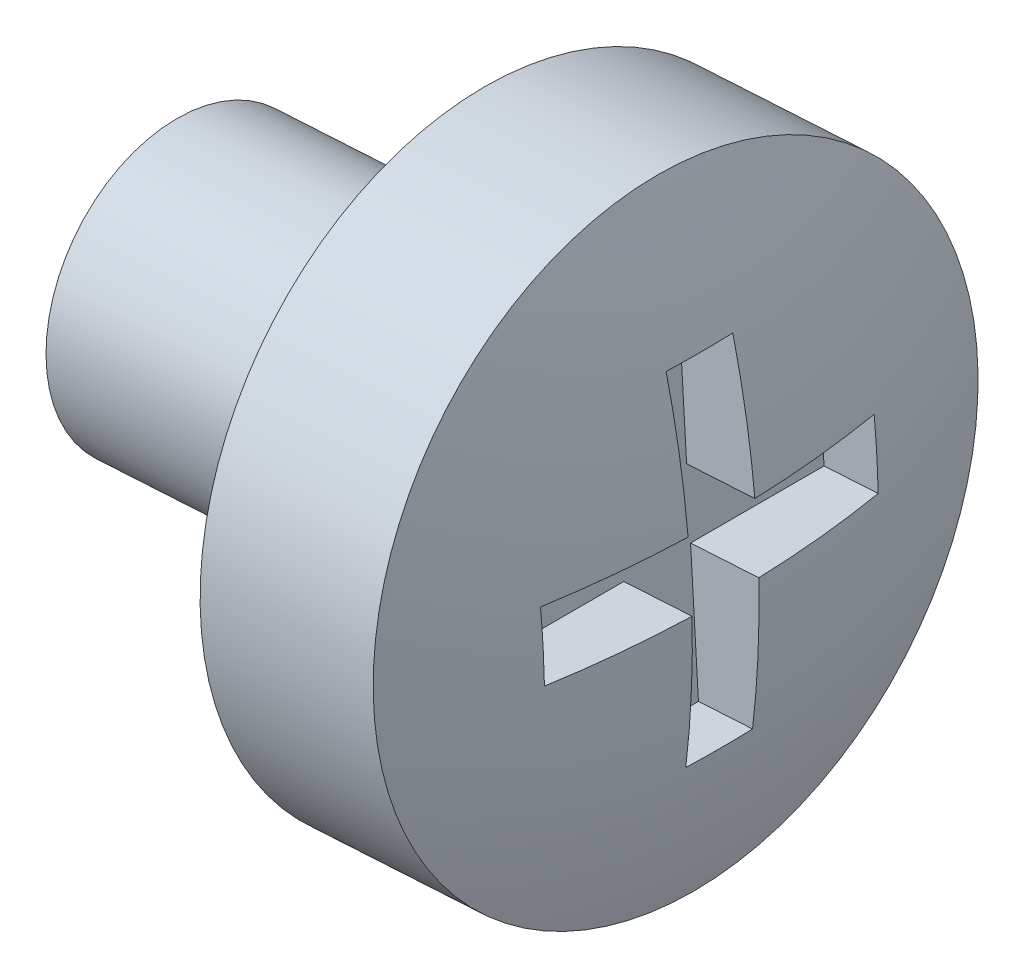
ISO-10303-21;
HEADER;
FILE_DESCRIPTION(('STEP AP214'),'2;1');
FILE_NAME('part.step','',(''),(''),'','','');
FILE_SCHEMA(('AUTOMOTIVE_DESIGN { 1 0 10303 214 1 1 1 1 }'));
ENDSEC;
DATA;
#1=APPLICATION_CONTEXT('core data for automotive mechanical design processes');
#2=APPLICATION_PROTOCOL_DEFINITION('international standard','automotive_design',2000,#1);
#3=PRODUCT_CONTEXT('',#1,'mechanical');
#4=PRODUCT('Part','Part','',(#3));
#5=PRODUCT_RELATED_PRODUCT_CATEGORY('part','',(#4));
#6=PRODUCT_DEFINITION_FORMATION('','',#4);
#7=PRODUCT_DEFINITION_CONTEXT('part definition',#1,'design');
#8=PRODUCT_DEFINITION('design','',#6,#7);
#9=PRODUCT_DEFINITION_SHAPE('','',#8);
#10=(LENGTH_UNIT() NAMED_UNIT(*) SI_UNIT(.MILLI.,.METRE.));
#11=(NAMED_UNIT(*) PLANE_ANGLE_UNIT() SI_UNIT($,.RADIAN.));
#12=(NAMED_UNIT(*) SI_UNIT($,.STERADIAN.) SOLID_ANGLE_UNIT());
#13=UNCERTAINTY_MEASURE_WITH_UNIT(LENGTH_MEASURE(1.E-05),#10,'distance_accuracy_value','');
#14=(GEOMETRIC_REPRESENTATION_CONTEXT(3) GLOBAL_UNCERTAINTY_ASSIGNED_CONTEXT((#13)) GLOBAL_UNIT_ASSIGNED_CONTEXT((#10,
#11,#12)) REPRESENTATION_CONTEXT('',''));
#15=CARTESIAN_POINT('',(0.,0.,0.));
#16=DIRECTION('',(0.,0.,1.));
#17=DIRECTION('',(1.,0.,0.));
#18=AXIS2_PLACEMENT_3D('',#15,#16,#17);
#19=CARTESIAN_POINT('',(12.5670575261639,53.0490706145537,0.));
#20=DIRECTION('',(-0.998253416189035,-0.0590772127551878,0.));
#21=DIRECTION('',(0.0590772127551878,-0.998253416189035,0.));
#22=AXIS2_PLACEMENT_3D('',#19,#20,#21);
#23=PLANE('',#22);
#24=DIRECTION('',(0.,0.,1.));
#25=VECTOR('',#24,1.);
#26=CARTESIAN_POINT('',(12.6911196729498,50.9527384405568,0.));
#27=LINE('',#26,#25);
#28=CARTESIAN_POINT('',(12.6911196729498,50.9527384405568,-0.42));
#29=VERTEX_POINT('',#28);
#30=CARTESIAN_POINT('',(12.6911196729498,50.9527384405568,0.42));
#31=VERTEX_POINT('',#30);
#32=EDGE_CURVE('E87',#29,#31,#27,.T.);
#33=ORIENTED_EDGE('',*,*,#32,.F.);
#34=DIRECTION('',(0.0590772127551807,-0.998253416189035,0.));
#35=VECTOR('',#34,1.);
#36=CARTESIAN_POINT('',(12.5918699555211,52.6298041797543,-0.42));
#37=LINE('',#36,#35);
#38=CARTESIAN_POINT('',(12.5918699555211,52.6298041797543,-0.42));
#39=VERTEX_POINT('',#38);
#40=EDGE_CURVE('E131',#39,#29,#37,.T.);
#41=ORIENTED_EDGE('',*,*,#40,.F.);
#42=DIRECTION('',(0.,0.,1.));
#43=VECTOR('',#42,1.);
#44=CARTESIAN_POINT('',(12.5918699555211,52.6298041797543,0.));
#45=LINE('',#44,#43);
#46=CARTESIAN_POINT('',(12.5918699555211,52.6298041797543,-2.1));
#47=VERTEX_POINT('',#46);
#48=EDGE_CURVE('E121',#47,#39,#45,.T.);
#49=ORIENTED_EDGE('',*,*,#48,.F.);
#50=DIRECTION('',(0.059077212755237,-0.998253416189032,0.));
#51=VECTOR('',#50,1.);
#52=CARTESIAN_POINT('',(12.5422450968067,53.4683370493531,-2.1));
#53=LINE('',#52,#51);
#54=CARTESIAN_POINT('',(12.5422450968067,53.4683370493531,-2.1));
#55=VERTEX_POINT('',#54);
#56=EDGE_CURVE('E144',#55,#47,#53,.T.);
#57=ORIENTED_EDGE('',*,*,#56,.F.);
#58=DIRECTION('',(0.,0.,1.));
#59=VECTOR('',#58,1.);
#60=CARTESIAN_POINT('',(12.5422450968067,53.4683370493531,0.));
#61=LINE('',#60,#59);
#62=CARTESIAN_POINT('',(12.5422450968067,53.4683370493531,-0.42));
#63=VERTEX_POINT('',#62);
#64=EDGE_CURVE('E150',#63,#55,#61,.F.);
#65=ORIENTED_EDGE('',*,*,#64,.F.);
#66=DIRECTION('',(0.0590772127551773,-0.998253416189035,0.));
#67=VECTOR('',#66,1.);
#68=CARTESIAN_POINT('',(12.442995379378,55.1454027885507,-0.42));
#69=LINE('',#68,#67);
#70=CARTESIAN_POINT('',(12.442995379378,55.1454027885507,-0.42));
#71=VERTEX_POINT('',#70);
#72=EDGE_CURVE('E156',#71,#63,#69,.T.);
#73=ORIENTED_EDGE('',*,*,#72,.F.);
#74=DIRECTION('',(0.,0.,1.));
#75=VECTOR('',#74,1.);
#76=CARTESIAN_POINT('',(12.442995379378,55.1454027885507,0.));
#77=LINE('',#76,#75);
#78=CARTESIAN_POINT('',(12.442995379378,55.1454027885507,0.42));
#79=VERTEX_POINT('',#78);
#80=EDGE_CURVE('E162',#79,#71,#77,.F.);
#81=ORIENTED_EDGE('',*,*,#80,.F.);
#82=DIRECTION('',(-0.0590772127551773,0.998253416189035,0.));
#83=VECTOR('',#82,1.);
#84=CARTESIAN_POINT('',(12.5422450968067,53.4683370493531,0.42));
#85=LINE('',#84,#83);
#86=CARTESIAN_POINT('',(12.5422450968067,53.4683370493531,0.42));
#87=VERTEX_POINT('',#86);
#88=EDGE_CURVE('E168',#87,#79,#85,.T.);
#89=ORIENTED_EDGE('',*,*,#88,.F.);
#90=DIRECTION('',(0.,0.,1.));
#91=VECTOR('',#90,1.);
#92=CARTESIAN_POINT('',(12.5422450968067,53.4683370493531,0.));
#93=LINE('',#92,#91);
#94=CARTESIAN_POINT('',(12.5422450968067,53.4683370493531,2.1));
#95=VERTEX_POINT('',#94);
#96=EDGE_CURVE('E174',#95,#87,#93,.F.);
#97=ORIENTED_EDGE('',*,*,#96,.F.);
#98=DIRECTION('',(-0.059077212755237,0.998253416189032,0.));
#99=VECTOR('',#98,1.);
#100=CARTESIAN_POINT('',(12.5918699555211,52.6298041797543,2.1));
#101=LINE('',#100,#99);
#102=CARTESIAN_POINT('',(12.5918699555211,52.6298041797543,2.1));
#103=VERTEX_POINT('',#102);
#104=EDGE_CURVE('E180',#103,#95,#101,.T.);
#105=ORIENTED_EDGE('',*,*,#104,.F.);
#106=DIRECTION('',(0.,0.,1.));
#107=VECTOR('',#106,1.);
#108=CARTESIAN_POINT('',(12.5918699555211,52.6298041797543,0.));
#109=LINE('',#108,#107);
#110=CARTESIAN_POINT('',(12.5918699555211,52.6298041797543,0.42));
#111=VERTEX_POINT('',#110);
#112=EDGE_CURVE('E186',#111,#103,#109,.T.);
#113=ORIENTED_EDGE('',*,*,#112,.F.);
#114=DIRECTION('',(-0.0590772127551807,0.998253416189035,0.));
#115=VECTOR('',#114,1.);
#116=CARTESIAN_POINT('',(12.6911196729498,50.9527384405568,0.42));
#117=LINE('',#116,#115);
#118=EDGE_CURVE('E190',#31,#111,#117,.T.);
#119=ORIENTED_EDGE('',*,*,#118,.F.);
#120=EDGE_LOOP('',(#33,#41,#49,#57,#65,#73,#81,#89,#97,#105,#113,#119));
#121=FACE_BOUND('',#120,.T.);
#122=ADVANCED_FACE('F16',(#121),#23,.F.);
#123=CARTESIAN_POINT('',(13.0037933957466,53.0749168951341,0.42));
#124=DIRECTION('',(0.,0.,-1.));
#125=DIRECTION('',(-1.,0.,0.));
#126=AXIS2_PLACEMENT_3D('',#123,#124,#125);
#127=PLANE('',#126);
#128=DIRECTION('',(-0.998253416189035,-0.0590772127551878,0.));
#129=VECTOR('',#128,1.);
#130=CARTESIAN_POINT('',(13.1278555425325,50.9785847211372,0.42));
#131=LINE('',#130,#129);
#132=CARTESIAN_POINT('',(13.3722815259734,50.9930499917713,0.419999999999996));
#133=VERTEX_POINT('',#132);
#134=EDGE_CURVE('E372',#31,#133,#131,.F.);
#135=ORIENTED_EDGE('',*,*,#134,.F.);
#136=ORIENTED_EDGE('',*,*,#118,.T.);
#137=DIRECTION('',(-0.998253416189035,-0.0590772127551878,0.));
#138=VECTOR('',#137,1.);
#139=CARTESIAN_POINT('',(13.0286058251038,52.6556504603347,0.42));
#140=LINE('',#139,#138);
#141=CARTESIAN_POINT('',(13.4506583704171,52.6806277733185,0.42));
#142=VERTEX_POINT('',#141);
#143=EDGE_CURVE('E75',#142,#111,#140,.T.);
#144=ORIENTED_EDGE('',*,*,#143,.F.);
#145=CARTESIAN_POINT('',(13.3722815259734,50.9930499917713,0.419999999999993));
#146=CARTESIAN_POINT('',(13.4051796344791,51.2733917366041,0.419999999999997));
#147=CARTESIAN_POINT('',(13.4281600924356,51.5541940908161,0.419999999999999));
#148=CARTESIAN_POINT('',(13.4542857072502,52.1167200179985,0.420000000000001));
#149=CARTESIAN_POINT('',(13.4574308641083,52.3984435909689,0.42));
#150=CARTESIAN_POINT('',(13.4506583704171,52.6806277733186,0.419999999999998));
#151=B_SPLINE_CURVE_WITH_KNOTS('',3,(#145,#146,#147,#148,#149,#150),.UNSPECIFIED.,.F.,.F.,(4,2,
4),(0.,0.845223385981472,1.69044677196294),.UNSPECIFIED.);
#152=EDGE_CURVE('E19',#133,#142,#151,.T.);
#153=ORIENTED_EDGE('',*,*,#152,.F.);
#154=EDGE_LOOP('',(#135,#136,#144,#153));
#155=FACE_BOUND('',#154,.T.);
#156=ADVANCED_FACE('F316',(#155),#127,.T.);
#157=CARTESIAN_POINT('',(13.0286058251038,52.6556504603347,0.));
#158=DIRECTION('',(-0.0590772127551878,0.998253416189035,0.));
#159=DIRECTION('',(-0.998253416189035,-0.0590772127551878,0.));
#160=AXIS2_PLACEMENT_3D('',#157,#158,#159);
#161=PLANE('',#160);
#162=ORIENTED_EDGE('',*,*,#112,.T.);
#163=DIRECTION('',(-0.998253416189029,-0.0590772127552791,0.));
#164=VECTOR('',#163,1.);
#165=CARTESIAN_POINT('',(13.2730318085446,52.6701157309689,2.1));
#166=LINE('',#165,#164);
#167=CARTESIAN_POINT('',(13.2730318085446,52.6701157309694,2.1));
#168=VERTEX_POINT('',#167);
#169=EDGE_CURVE('E183',#168,#103,#166,.T.);
#170=ORIENTED_EDGE('',*,*,#169,.F.);
#171=CARTESIAN_POINT('',(1.48630070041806,51.9725701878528,0.));
#172=DIRECTION('',(0.0590772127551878,-0.998253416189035,0.));
#173=DIRECTION('',(0.998253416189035,0.0590772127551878,0.));
#174=AXIS2_PLACEMENT_3D('',#171,#172,#173);
#175=CIRCLE('',#174,11.9926477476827);
#176=EDGE_CURVE('E308',#142,#168,#175,.T.);
#177=ORIENTED_EDGE('',*,*,#176,.F.);
#178=ORIENTED_EDGE('',*,*,#143,.T.);
#179=EDGE_LOOP('',(#162,#170,#177,#178));
#180=FACE_BOUND('',#179,.T.);
#181=ADVANCED_FACE('F313',(#180),#161,.T.);
#182=CARTESIAN_POINT('',(13.0037933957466,53.0749168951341,2.1));
#183=DIRECTION('',(0.,0.,-1.));
#184=DIRECTION('',(-1.,0.,0.));
#185=AXIS2_PLACEMENT_3D('',#182,#183,#184);
#186=PLANE('',#185);
#187=ORIENTED_EDGE('',*,*,#104,.T.);
#188=DIRECTION('',(0.998253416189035,0.0590772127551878,0.));
#189=VECTOR('',#188,1.);
#190=CARTESIAN_POINT('',(12.9789809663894,53.4941833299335,2.1));
#191=LINE('',#190,#189);
#192=CARTESIAN_POINT('',(13.2234069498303,53.5086486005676,2.1));
#193=VERTEX_POINT('',#192);
#194=EDGE_CURVE('E177',#193,#95,#191,.F.);
#195=ORIENTED_EDGE('',*,*,#194,.F.);
#196=CARTESIAN_POINT('',(13.2730318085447,52.6701157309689,2.1));
#197=CARTESIAN_POINT('',(13.2697306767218,52.8101653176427,2.1));
#198=CARTESIAN_POINT('',(13.2639447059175,52.9500678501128,2.1));
#199=CARTESIAN_POINT('',(13.247403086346,53.2295788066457,2.1));
#200=CARTESIAN_POINT('',(13.2366474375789,53.3691872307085,2.1));
#201=CARTESIAN_POINT('',(13.2234069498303,53.5086486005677,2.1));
#202=B_SPLINE_CURVE_WITH_KNOTS('',3,(#196,#197,#198,#199,#200,#201),.UNSPECIFIED.,.F.,.F.,(4,2,
4),(0.,0.420066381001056,0.840132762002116),.UNSPECIFIED.);
#203=EDGE_CURVE('E303',#168,#193,#202,.T.);
#204=ORIENTED_EDGE('',*,*,#203,.F.);
#205=ORIENTED_EDGE('',*,*,#169,.T.);
#206=EDGE_LOOP('',(#187,#195,#204,#205));
#207=FACE_BOUND('',#206,.T.);
#208=ADVANCED_FACE('F309',(#207),#186,.T.);
#209=CARTESIAN_POINT('',(12.9789809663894,53.4941833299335,0.));
#210=DIRECTION('',(0.0590772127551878,-0.998253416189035,0.));
#211=DIRECTION('',(0.998253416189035,0.0590772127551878,0.));
#212=AXIS2_PLACEMENT_3D('',#209,#210,#211);
#213=PLANE('',#212);
#214=ORIENTED_EDGE('',*,*,#96,.T.);
#215=DIRECTION('',(-0.99825341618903,-0.0590772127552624,0.));
#216=VECTOR('',#215,1.);
#217=CARTESIAN_POINT('',(13.4010335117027,53.5191606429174,0.42));
#218=LINE('',#217,#216);
#219=CARTESIAN_POINT('',(13.4010335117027,53.5191606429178,0.419999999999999));
#220=VERTEX_POINT('',#219);
#221=EDGE_CURVE('E171',#220,#87,#218,.T.);
#222=ORIENTED_EDGE('',*,*,#221,.F.);
#223=CARTESIAN_POINT('',(1.4366758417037,52.8111030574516,0.));
#224=DIRECTION('',(0.0590772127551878,-0.998253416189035,0.));
#225=DIRECTION('',(0.998253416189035,0.0590772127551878,0.));
#226=AXIS2_PLACEMENT_3D('',#223,#224,#225);
#227=CIRCLE('',#226,11.9926477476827);
#228=EDGE_CURVE('E300',#193,#220,#227,.F.);
#229=ORIENTED_EDGE('',*,*,#228,.F.);
#230=ORIENTED_EDGE('',*,*,#194,.T.);
#231=EDGE_LOOP('',(#214,#222,#229,#230));
#232=FACE_BOUND('',#231,.T.);
#233=ADVANCED_FACE('F291',(#232),#213,.T.);
#234=CARTESIAN_POINT('',(13.0037933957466,53.0749168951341,0.42));
#235=DIRECTION('',(0.,0.,-1.));
#236=DIRECTION('',(-1.,0.,0.));
#237=AXIS2_PLACEMENT_3D('',#234,#235,#236);
#238=PLANE('',#237);
#239=DIRECTION('',(0.998253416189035,0.0590772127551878,0.));
#240=VECTOR('',#239,1.);
#241=CARTESIAN_POINT('',(12.8797312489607,55.1712490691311,0.42));
#242=LINE('',#241,#240);
#243=CARTESIAN_POINT('',(13.1241572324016,55.1857143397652,0.42));
#244=VERTEX_POINT('',#243);
#245=EDGE_CURVE('E165',#244,#79,#242,.F.);
#246=ORIENTED_EDGE('',*,*,#245,.F.);
#247=CARTESIAN_POINT('',(13.4010335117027,53.5191606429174,0.419999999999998));
#248=CARTESIAN_POINT('',(13.3744756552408,53.8001739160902,0.42));
#249=CARTESIAN_POINT('',(13.3381237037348,54.0795600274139,0.42));
#250=CARTESIAN_POINT('',(13.2458316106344,54.6350779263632,0.42));
#251=CARTESIAN_POINT('',(13.1898914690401,54.9112097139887,0.419999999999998));
#252=CARTESIAN_POINT('',(13.1241572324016,55.1857143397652,0.419999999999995));
#253=B_SPLINE_CURVE_WITH_KNOTS('',3,(#247,#248,#249,#250,#251,#252),.UNSPECIFIED.,.F.,.F.,(4,2,
4),(0.,0.845223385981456,1.69044677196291),.UNSPECIFIED.);
#254=EDGE_CURVE('E294',#220,#244,#253,.T.);
#255=ORIENTED_EDGE('',*,*,#254,.F.);
#256=ORIENTED_EDGE('',*,*,#221,.T.);
#257=ORIENTED_EDGE('',*,*,#88,.T.);
#258=EDGE_LOOP('',(#246,#255,#256,#257));
#259=FACE_BOUND('',#258,.T.);
#260=ADVANCED_FACE('F286',(#259),#238,.T.);
#261=CARTESIAN_POINT('',(12.8797312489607,55.1712490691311,0.));
#262=DIRECTION('',(0.0590772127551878,-0.998253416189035,0.));
#263=DIRECTION('',(0.998253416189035,0.0590772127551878,0.));
#264=AXIS2_PLACEMENT_3D('',#261,#262,#263);
#265=PLANE('',#264);
#266=DIRECTION('',(-0.998253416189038,-0.0590772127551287,0.));
#267=VECTOR('',#266,1.);
#268=CARTESIAN_POINT('',(13.1241572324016,55.1857143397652,-0.42));
#269=LINE('',#268,#267);
#270=CARTESIAN_POINT('',(13.1241572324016,55.1857143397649,-0.420000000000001));
#271=VERTEX_POINT('',#270);
#272=EDGE_CURVE('E159',#271,#71,#269,.T.);
#273=ORIENTED_EDGE('',*,*,#272,.F.);
#274=CARTESIAN_POINT('',(1.33742612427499,54.4881687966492,0.));
#275=DIRECTION('',(0.0590772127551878,-0.998253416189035,0.));
#276=DIRECTION('',(0.998253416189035,0.0590772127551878,0.));
#277=AXIS2_PLACEMENT_3D('',#274,#275,#276);
#278=CIRCLE('',#277,11.8148212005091);
#279=EDGE_CURVE('E276',#244,#271,#278,.F.);
#280=ORIENTED_EDGE('',*,*,#279,.F.);
#281=ORIENTED_EDGE('',*,*,#245,.T.);
#282=ORIENTED_EDGE('',*,*,#80,.T.);
#283=EDGE_LOOP('',(#273,#280,#281,#282));
#284=FACE_BOUND('',#283,.T.);
#285=ADVANCED_FACE('F282',(#284),#265,.T.);
#286=CARTESIAN_POINT('',(13.0037933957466,53.0749168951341,-0.42));
#287=DIRECTION('',(0.,0.,1.));
#288=DIRECTION('',(1.,0.,0.));
#289=AXIS2_PLACEMENT_3D('',#286,#287,#288);
#290=PLANE('',#289);
#291=ORIENTED_EDGE('',*,*,#272,.T.);
#292=ORIENTED_EDGE('',*,*,#72,.T.);
#293=DIRECTION('',(0.998253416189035,0.0590772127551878,0.));
#294=VECTOR('',#293,1.);
#295=CARTESIAN_POINT('',(12.9789809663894,53.4941833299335,-0.42));
#296=LINE('',#295,#294);
#297=CARTESIAN_POINT('',(13.4010335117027,53.5191606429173,-0.42));
#298=VERTEX_POINT('',#297);
#299=EDGE_CURVE('E153',#298,#63,#296,.F.);
#300=ORIENTED_EDGE('',*,*,#299,.F.);
#301=CARTESIAN_POINT('',(13.1241572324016,55.1857143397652,-0.420000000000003));
#302=CARTESIAN_POINT('',(13.1898914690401,54.9112097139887,-0.420000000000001));
#303=CARTESIAN_POINT('',(13.2458316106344,54.6350779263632,-0.42));
#304=CARTESIAN_POINT('',(13.3381237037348,54.0795600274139,-0.42));
#305=CARTESIAN_POINT('',(13.3744756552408,53.8001739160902,-0.42));
#306=CARTESIAN_POINT('',(13.4010335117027,53.5191606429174,-0.42));
#307=B_SPLINE_CURVE_WITH_KNOTS('',3,(#301,#302,#303,#304,#305,#306),.UNSPECIFIED.,.F.,.F.,(4,2,
4),(0.,0.845223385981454,1.6904467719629),.UNSPECIFIED.);
#308=EDGE_CURVE('E270',#271,#298,#307,.T.);
#309=ORIENTED_EDGE('',*,*,#308,.F.);
#310=EDGE_LOOP('',(#291,#292,#300,#309));
#311=FACE_BOUND('',#310,.T.);
#312=ADVANCED_FACE('F278',(#311),#290,.T.);
#313=CARTESIAN_POINT('',(12.9789809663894,53.4941833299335,0.));
#314=DIRECTION('',(0.0590772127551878,-0.998253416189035,0.));
#315=DIRECTION('',(0.998253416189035,0.0590772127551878,0.));
#316=AXIS2_PLACEMENT_3D('',#313,#314,#315);
#317=PLANE('',#316);
#318=DIRECTION('',(-0.998253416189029,-0.0590772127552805,0.));
#319=VECTOR('',#318,1.);
#320=CARTESIAN_POINT('',(13.2234069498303,53.5086486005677,-2.1));
#321=LINE('',#320,#319);
#322=CARTESIAN_POINT('',(13.2234069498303,53.5086486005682,-2.1));
#323=VERTEX_POINT('',#322);
#324=EDGE_CURVE('E147',#323,#55,#321,.T.);
#325=ORIENTED_EDGE('',*,*,#324,.F.);
#326=CARTESIAN_POINT('',(1.4366758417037,52.8111030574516,0.));
#327=DIRECTION('',(0.0590772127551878,-0.998253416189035,0.));
#328=DIRECTION('',(0.998253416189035,0.0590772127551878,0.));
#329=AXIS2_PLACEMENT_3D('',#326,#327,#328);
#330=CIRCLE('',#329,11.9926477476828);
#331=EDGE_CURVE('E267',#298,#323,#330,.F.);
#332=ORIENTED_EDGE('',*,*,#331,.F.);
#333=ORIENTED_EDGE('',*,*,#299,.T.);
#334=ORIENTED_EDGE('',*,*,#64,.T.);
#335=EDGE_LOOP('',(#325,#332,#333,#334));
#336=FACE_BOUND('',#335,.T.);
#337=ADVANCED_FACE('F258',(#336),#317,.T.);
#338=CARTESIAN_POINT('',(13.0037933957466,53.0749168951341,-2.1));
#339=DIRECTION('',(0.,0.,1.));
#340=DIRECTION('',(1.,0.,0.));
#341=AXIS2_PLACEMENT_3D('',#338,#339,#340);
#342=PLANE('',#341);
#343=ORIENTED_EDGE('',*,*,#56,.T.);
#344=DIRECTION('',(-0.998253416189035,-0.0590772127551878,0.));
#345=VECTOR('',#344,1.);
#346=CARTESIAN_POINT('',(13.0286058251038,52.6556504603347,-2.1));
#347=LINE('',#346,#345);
#348=CARTESIAN_POINT('',(13.2730318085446,52.6701157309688,-2.1));
#349=VERTEX_POINT('',#348);
#350=EDGE_CURVE('E127',#349,#47,#347,.T.);
#351=ORIENTED_EDGE('',*,*,#350,.F.);
#352=CARTESIAN_POINT('',(13.2234069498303,53.5086486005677,-2.1));
#353=CARTESIAN_POINT('',(13.2366474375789,53.3691872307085,-2.1));
#354=CARTESIAN_POINT('',(13.247403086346,53.2295788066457,-2.1));
#355=CARTESIAN_POINT('',(13.2639447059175,52.9500678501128,-2.1));
#356=CARTESIAN_POINT('',(13.2697306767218,52.8101653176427,-2.1));
#357=CARTESIAN_POINT('',(13.2730318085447,52.6701157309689,-2.10000000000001));
#358=B_SPLINE_CURVE_WITH_KNOTS('',3,(#352,#353,#354,#355,#356,#357),.UNSPECIFIED.,.F.,.F.,(4,2,
4),(0.,0.420066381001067,0.840132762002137),.UNSPECIFIED.);
#359=EDGE_CURVE('E261',#323,#349,#358,.T.);
#360=ORIENTED_EDGE('',*,*,#359,.F.);
#361=ORIENTED_EDGE('',*,*,#324,.T.);
#362=EDGE_LOOP('',(#343,#351,#360,#361));
#363=FACE_BOUND('',#362,.T.);
#364=ADVANCED_FACE('F254',(#363),#342,.T.);
#365=CARTESIAN_POINT('',(13.0286058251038,52.6556504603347,0.));
#366=DIRECTION('',(-0.0590772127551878,0.998253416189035,0.));
#367=DIRECTION('',(-0.998253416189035,-0.0590772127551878,0.));
#368=AXIS2_PLACEMENT_3D('',#365,#366,#367);
#369=PLANE('',#368);
#370=ORIENTED_EDGE('',*,*,#350,.T.);
#371=ORIENTED_EDGE('',*,*,#48,.T.);
#372=DIRECTION('',(-0.998253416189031,-0.0590772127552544,0.));
#373=VECTOR('',#372,1.);
#374=CARTESIAN_POINT('',(13.4506583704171,52.6806277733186,-0.42));
#375=LINE('',#374,#373);
#376=CARTESIAN_POINT('',(13.4506583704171,52.680627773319,-0.42));
#377=VERTEX_POINT('',#376);
#378=EDGE_CURVE('E126',#377,#39,#375,.T.);
#379=ORIENTED_EDGE('',*,*,#378,.F.);
#380=CARTESIAN_POINT('',(1.48630070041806,51.9725701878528,0.));
#381=DIRECTION('',(0.0590772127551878,-0.998253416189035,0.));
#382=DIRECTION('',(0.998253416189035,0.0590772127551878,0.));
#383=AXIS2_PLACEMENT_3D('',#380,#381,#382);
#384=CIRCLE('',#383,11.9926477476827);
#385=EDGE_CURVE('E241',#349,#377,#384,.T.);
#386=ORIENTED_EDGE('',*,*,#385,.F.);
#387=EDGE_LOOP('',(#370,#371,#379,#386));
#388=FACE_BOUND('',#387,.T.);
#389=ADVANCED_FACE('F123',(#388),#369,.T.);
#390=CARTESIAN_POINT('',(13.0037933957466,53.0749168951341,-0.42));
#391=DIRECTION('',(0.,0.,1.));
#392=DIRECTION('',(1.,0.,0.));
#393=AXIS2_PLACEMENT_3D('',#390,#391,#392);
#394=PLANE('',#393);
#395=DIRECTION('',(-0.998253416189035,-0.0590772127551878,0.));
#396=VECTOR('',#395,1.);
#397=CARTESIAN_POINT('',(13.1278555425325,50.9785847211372,-0.42));
#398=LINE('',#397,#396);
#399=CARTESIAN_POINT('',(13.3722815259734,50.9930499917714,-0.42));
#400=VERTEX_POINT('',#399);
#401=EDGE_CURVE('E38',#400,#29,#398,.T.);
#402=ORIENTED_EDGE('',*,*,#401,.F.);
#403=CARTESIAN_POINT('',(13.4506583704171,52.6806277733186,-0.42));
#404=CARTESIAN_POINT('',(13.4574308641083,52.3984435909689,-0.42));
#405=CARTESIAN_POINT('',(13.4542857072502,52.1167200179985,-0.42));
#406=CARTESIAN_POINT('',(13.4281600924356,51.5541940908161,-0.42));
#407=CARTESIAN_POINT('',(13.4051796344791,51.2733917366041,-0.420000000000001));
#408=CARTESIAN_POINT('',(13.3722815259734,50.9930499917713,-0.420000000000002));
#409=B_SPLINE_CURVE_WITH_KNOTS('',3,(#403,#404,#405,#406,#407,#408),.UNSPECIFIED.,.F.,.F.,(4,2,
4),(0.,0.845223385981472,1.69044677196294),.UNSPECIFIED.);
#410=EDGE_CURVE('E134',#377,#400,#409,.T.);
#411=ORIENTED_EDGE('',*,*,#410,.F.);
#412=ORIENTED_EDGE('',*,*,#378,.T.);
#413=ORIENTED_EDGE('',*,*,#40,.T.);
#414=EDGE_LOOP('',(#402,#411,#412,#413));
#415=FACE_BOUND('',#414,.T.);
#416=ADVANCED_FACE('F133',(#415),#394,.T.);
#417=CARTESIAN_POINT('',(13.1278555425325,50.9785847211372,0.));
#418=DIRECTION('',(-0.0590772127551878,0.998253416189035,0.));
#419=DIRECTION('',(-0.998253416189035,-0.0590772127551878,0.));
#420=AXIS2_PLACEMENT_3D('',#417,#418,#419);
#421=PLANE('',#420);
#422=ORIENTED_EDGE('',*,*,#134,.T.);
#423=CARTESIAN_POINT('',(1.58555041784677,50.2955044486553,0.));
#424=DIRECTION('',(0.0590772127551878,-0.998253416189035,0.));
#425=DIRECTION('',(0.998253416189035,0.0590772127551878,0.));
#426=AXIS2_PLACEMENT_3D('',#423,#424,#425);
#427=CIRCLE('',#426,11.8148212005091);
#428=EDGE_CURVE('E82',#400,#133,#427,.T.);
#429=ORIENTED_EDGE('',*,*,#428,.F.);
#430=ORIENTED_EDGE('',*,*,#401,.T.);
#431=ORIENTED_EDGE('',*,*,#32,.T.);
#432=EDGE_LOOP('',(#422,#429,#430,#431));
#433=FACE_BOUND('',#432,.T.);
#434=ADVANCED_FACE('F251',(#433),#421,.T.);
#435=CARTESIAN_POINT('',(1.46148827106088,52.3918366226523,0.));
#436=DIRECTION('',(0.0590772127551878,-0.998253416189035,0.));
#437=DIRECTION('',(0.,0.,1.));
#438=AXIS2_PLACEMENT_3D('',#435,#436,#437);
#439=SPHERICAL_SURFACE('',#438,12.);
#440=ORIENTED_EDGE('',*,*,#254,.T.);
#441=ORIENTED_EDGE('',*,*,#279,.T.);
#442=ORIENTED_EDGE('',*,*,#308,.T.);
#443=ORIENTED_EDGE('',*,*,#331,.T.);
#444=ORIENTED_EDGE('',*,*,#359,.T.);
#445=ORIENTED_EDGE('',*,*,#385,.T.);
#446=ORIENTED_EDGE('',*,*,#410,.T.);
#447=ORIENTED_EDGE('',*,*,#428,.T.);
#448=ORIENTED_EDGE('',*,*,#152,.T.);
#449=ORIENTED_EDGE('',*,*,#176,.T.);
#450=ORIENTED_EDGE('',*,*,#203,.T.);
#451=ORIENTED_EDGE('',*,*,#228,.T.);
#452=EDGE_LOOP('',(#440,#441,#442,#443,#444,#445,#446,#447,#448,#449,#450,#451));
#453=FACE_BOUND('',#452,.T.);
#454=CARTESIAN_POINT('',(12.8240505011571,53.064279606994,0.));
#455=DIRECTION('',(0.998253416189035,0.0590772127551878,0.));
#456=DIRECTION('',(-0.0590772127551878,0.998253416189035,0.));
#457=AXIS2_PLACEMENT_3D('',#454,#455,#456);
#458=CIRCLE('',#457,3.8);
#459=CARTESIAN_POINT('',(12.5995570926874,56.8576425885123,0.));
#460=VERTEX_POINT('',#459);
#461=EDGE_CURVE('E232',#460,#460,#458,.F.);
#462=ORIENTED_EDGE('',*,*,#461,.F.);
#463=EDGE_LOOP('',(#462));
#464=FACE_BOUND('',#463,.T.);
#465=ADVANCED_FACE('F243',(#453,#464),#439,.T.);
#466=CARTESIAN_POINT('',(6.65240603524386,52.6990381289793,0.));
#467=DIRECTION('',(-0.998253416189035,-0.0590772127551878,0.));
#468=DIRECTION('',(0.0590772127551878,-0.998253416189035,0.));
#469=AXIS2_PLACEMENT_3D('',#466,#467,#468);
#470=PLANE('',#469);
#471=CARTESIAN_POINT('',(6.65240603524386,52.6990381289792,0.));
#472=DIRECTION('',(0.998253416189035,0.0590772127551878,0.));
#473=DIRECTION('',(-0.0590772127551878,0.998253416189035,0.));
#474=AXIS2_PLACEMENT_3D('',#471,#472,#473);
#475=CIRCLE('',#474,1.75);
#476=CARTESIAN_POINT('',(6.54902091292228,54.44598160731,0.));
#477=VERTEX_POINT('',#476);
#478=EDGE_CURVE('E229',#477,#477,#475,.T.);
#479=ORIENTED_EDGE('',*,*,#478,.F.);
#480=EDGE_LOOP('',(#479));
#481=FACE_BOUND('',#480,.T.);
#482=ADVANCED_FACE('F339',(#481),#470,.T.);
#483=CARTESIAN_POINT('',(11.7347351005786,52.999813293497,0.));
#484=DIRECTION('',(0.998253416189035,0.0590772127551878,0.));
#485=DIRECTION('',(-0.0590772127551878,0.998253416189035,0.));
#486=AXIS2_PLACEMENT_3D('',#483,#484,#485);
#487=CYLINDRICAL_SURFACE('',#486,3.8);
#488=CARTESIAN_POINT('',(10.6454197,52.93534698,0.));
#489=DIRECTION('',(0.998253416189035,0.0590772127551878,0.));
#490=DIRECTION('',(-0.0590772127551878,0.998253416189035,0.));
#491=AXIS2_PLACEMENT_3D('',#488,#489,#490);
#492=CIRCLE('',#491,3.8);
#493=CARTESIAN_POINT('',(10.4209262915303,56.7287099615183,0.));
#494=VERTEX_POINT('',#493);
#495=EDGE_CURVE('E29',#494,#494,#492,.F.);
#496=ORIENTED_EDGE('',*,*,#495,.F.);
#497=EDGE_LOOP('',(#496));
#498=FACE_BOUND('',#497,.T.);
#499=ORIENTED_EDGE('',*,*,#461,.T.);
#500=EDGE_LOOP('',(#499));
#501=FACE_BOUND('',#500,.T.);
#502=ADVANCED_FACE('F333',(#498,#501),#487,.T.);
#503=CARTESIAN_POINT('',(8.64891286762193,52.8171925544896,0.));
#504=DIRECTION('',(0.998253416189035,0.0590772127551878,0.));
#505=DIRECTION('',(-0.0590772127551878,0.998253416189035,0.));
#506=AXIS2_PLACEMENT_3D('',#503,#504,#505);
#507=CYLINDRICAL_SURFACE('',#506,1.75);
#508=CARTESIAN_POINT('',(10.6454197,52.93534698,0.));
#509=DIRECTION('',(0.998253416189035,0.0590772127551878,0.));
#510=DIRECTION('',(-0.0590772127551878,0.998253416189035,0.));
#511=AXIS2_PLACEMENT_3D('',#508,#509,#510);
#512=CIRCLE('',#511,1.75);
#513=CARTESIAN_POINT('',(10.5420345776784,54.6822904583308,0.));
#514=VERTEX_POINT('',#513);
#515=EDGE_CURVE('E11',#514,#514,#512,.T.);
#516=ORIENTED_EDGE('',*,*,#515,.F.);
#517=EDGE_LOOP('',(#516));
#518=FACE_BOUND('',#517,.T.);
#519=ORIENTED_EDGE('',*,*,#478,.T.);
#520=EDGE_LOOP('',(#519));
#521=FACE_BOUND('',#520,.T.);
#522=ADVANCED_FACE('F327',(#518,#521),#507,.T.);
#523=CARTESIAN_POINT('',(10.6454197,52.93534698,0.));
#524=DIRECTION('',(-0.998253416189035,-0.0590772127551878,0.));
#525=DIRECTION('',(0.0590772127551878,-0.998253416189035,0.));
#526=AXIS2_PLACEMENT_3D('',#523,#524,#525);
#527=PLANE('',#526);
#528=ORIENTED_EDGE('',*,*,#515,.T.);
#529=EDGE_LOOP('',(#528));
#530=FACE_BOUND('',#529,.T.);
#531=ORIENTED_EDGE('',*,*,#495,.T.);
#532=EDGE_LOOP('',(#531));
#533=FACE_BOUND('',#532,.T.);
#534=ADVANCED_FACE('F325',(#530,#533),#527,.T.);
#535=CLOSED_SHELL('',(#122,#156,#181,#208,#233,#260,#285,#312,#337,#364,#389,#416,#434,#465,
#482,#502,#522,#534));
#536=MANIFOLD_SOLID_BREP('B1',#535);
#537=ADVANCED_BREP_SHAPE_REPRESENTATION('',(#18,#536),#14);
#538=SHAPE_DEFINITION_REPRESENTATION(#9,#537);
ENDSEC;
END-ISO-10303-21;
